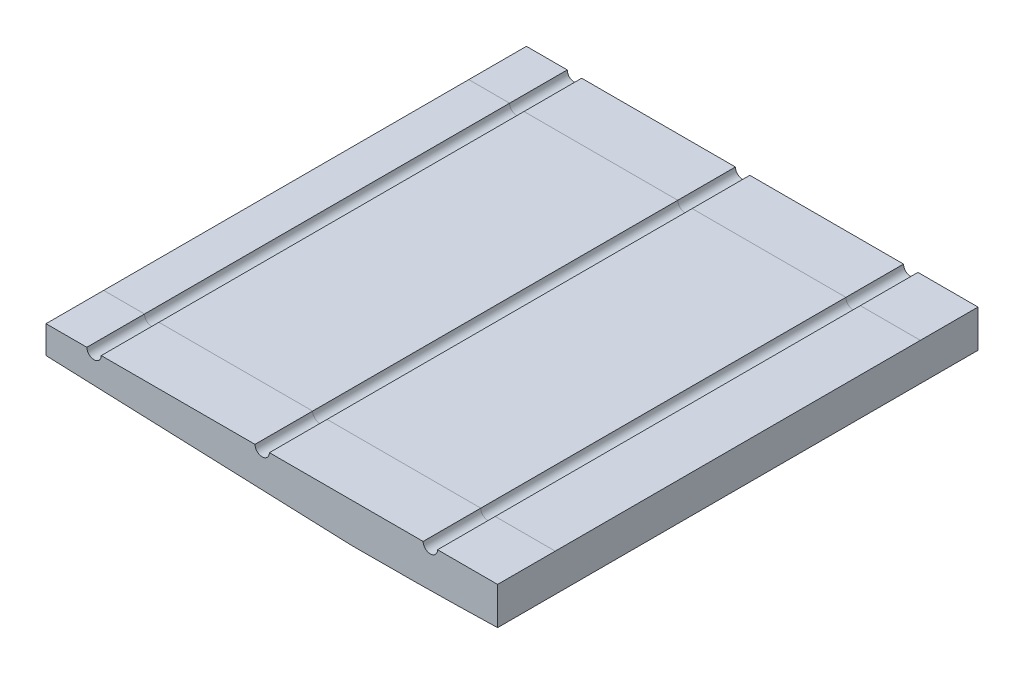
ISO-10303-21;
HEADER;
FILE_DESCRIPTION(('STEP AP214'),'2;1');
FILE_NAME('part.step','',(''),(''),'','','');
FILE_SCHEMA(('AUTOMOTIVE_DESIGN { 1 0 10303 214 1 1 1 1 }'));
ENDSEC;
DATA;
#1=APPLICATION_CONTEXT('core data for automotive mechanical design processes');
#2=APPLICATION_PROTOCOL_DEFINITION('international standard','automotive_design',2000,#1);
#3=PRODUCT_CONTEXT('',#1,'mechanical');
#4=PRODUCT('Part','Part','',(#3));
#5=PRODUCT_RELATED_PRODUCT_CATEGORY('part','',(#4));
#6=PRODUCT_DEFINITION_FORMATION('','',#4);
#7=PRODUCT_DEFINITION_CONTEXT('part definition',#1,'design');
#8=PRODUCT_DEFINITION('design','',#6,#7);
#9=PRODUCT_DEFINITION_SHAPE('','',#8);
#10=(LENGTH_UNIT() NAMED_UNIT(*) SI_UNIT(.MILLI.,.METRE.));
#11=(NAMED_UNIT(*) PLANE_ANGLE_UNIT() SI_UNIT($,.RADIAN.));
#12=(NAMED_UNIT(*) SI_UNIT($,.STERADIAN.) SOLID_ANGLE_UNIT());
#13=UNCERTAINTY_MEASURE_WITH_UNIT(LENGTH_MEASURE(1.E-05),#10,'distance_accuracy_value','');
#14=(GEOMETRIC_REPRESENTATION_CONTEXT(3) GLOBAL_UNCERTAINTY_ASSIGNED_CONTEXT((#13)) GLOBAL_UNIT_ASSIGNED_CONTEXT((#10,
#11,#12)) REPRESENTATION_CONTEXT('',''));
#15=CARTESIAN_POINT('',(0.,0.,0.));
#16=DIRECTION('',(0.,0.,1.));
#17=DIRECTION('',(1.,0.,0.));
#18=AXIS2_PLACEMENT_3D('',#15,#16,#17);
#19=CARTESIAN_POINT('',(0.,5.75,100.));
#20=DIRECTION('',(0.,-1.,0.));
#21=DIRECTION('',(0.,0.,-1.));
#22=AXIS2_PLACEMENT_3D('',#19,#20,#21);
#23=PLANE('',#22);
#24=DIRECTION('',(1.,0.,0.));
#25=VECTOR('',#24,1.);
#26=CARTESIAN_POINT('',(0.,5.75,12.));
#27=LINE('',#26,#25);
#28=CARTESIAN_POINT('',(11.5,5.75,12.));
#29=VERTEX_POINT('',#28);
#30=CARTESIAN_POINT('',(43.5,5.75,12.));
#31=VERTEX_POINT('',#30);
#32=EDGE_CURVE('E11',#29,#31,#27,.T.);
#33=ORIENTED_EDGE('',*,*,#32,.F.);
#34=DIRECTION('',(0.,0.,1.));
#35=VECTOR('',#34,1.);
#36=CARTESIAN_POINT('',(11.5,5.75,0.));
#37=LINE('',#36,#35);
#38=CARTESIAN_POINT('',(11.5,5.75,88.));
#39=VERTEX_POINT('',#38);
#40=EDGE_CURVE('E328',#29,#39,#37,.T.);
#41=ORIENTED_EDGE('',*,*,#40,.T.);
#42=DIRECTION('',(1.,0.,0.));
#43=VECTOR('',#42,1.);
#44=CARTESIAN_POINT('',(0.,5.75,88.));
#45=LINE('',#44,#43);
#46=CARTESIAN_POINT('',(43.5,5.75,88.));
#47=VERTEX_POINT('',#46);
#48=EDGE_CURVE('E274',#39,#47,#45,.T.);
#49=ORIENTED_EDGE('',*,*,#48,.T.);
#50=DIRECTION('',(0.,0.,1.));
#51=VECTOR('',#50,1.);
#52=CARTESIAN_POINT('',(43.5,5.75,0.));
#53=LINE('',#52,#51);
#54=EDGE_CURVE('E441',#47,#31,#53,.F.);
#55=ORIENTED_EDGE('',*,*,#54,.T.);
#56=EDGE_LOOP('',(#33,#41,#49,#55));
#57=FACE_BOUND('',#56,.T.);
#58=ADVANCED_FACE('F46',(#57),#23,.F.);
#59=DIRECTION('',(1.,0.,0.));
#60=VECTOR('',#59,1.);
#61=CARTESIAN_POINT('',(0.,5.75,12.));
#62=LINE('',#61,#60);
#63=CARTESIAN_POINT('',(46.5,5.75,12.));
#64=VERTEX_POINT('',#63);
#65=CARTESIAN_POINT('',(78.5,5.75,12.));
#66=VERTEX_POINT('',#65);
#67=EDGE_CURVE('E57',#64,#66,#62,.T.);
#68=ORIENTED_EDGE('',*,*,#67,.F.);
#69=DIRECTION('',(0.,0.,1.));
#70=VECTOR('',#69,1.);
#71=CARTESIAN_POINT('',(46.5,5.75,0.));
#72=LINE('',#71,#70);
#73=CARTESIAN_POINT('',(46.5,5.75,88.));
#74=VERTEX_POINT('',#73);
#75=EDGE_CURVE('E431',#64,#74,#72,.T.);
#76=ORIENTED_EDGE('',*,*,#75,.T.);
#77=DIRECTION('',(1.,0.,0.));
#78=VECTOR('',#77,1.);
#79=CARTESIAN_POINT('',(0.,5.75,88.));
#80=LINE('',#79,#78);
#81=CARTESIAN_POINT('',(78.5,5.75,88.));
#82=VERTEX_POINT('',#81);
#83=EDGE_CURVE('E287',#74,#82,#80,.T.);
#84=ORIENTED_EDGE('',*,*,#83,.T.);
#85=DIRECTION('',(0.,0.,1.));
#86=VECTOR('',#85,1.);
#87=CARTESIAN_POINT('',(78.5,5.75,0.));
#88=LINE('',#87,#86);
#89=EDGE_CURVE('E198',#82,#66,#88,.F.);
#90=ORIENTED_EDGE('',*,*,#89,.T.);
#91=EDGE_LOOP('',(#68,#76,#84,#90));
#92=FACE_BOUND('',#91,.T.);
#93=ADVANCED_FACE('F494',(#92),#23,.F.);
#94=DIRECTION('',(1.,0.,0.));
#95=VECTOR('',#94,1.);
#96=CARTESIAN_POINT('',(0.,5.75,12.));
#97=LINE('',#96,#95);
#98=CARTESIAN_POINT('',(81.5,5.75,12.));
#99=VERTEX_POINT('',#98);
#100=CARTESIAN_POINT('',(94.,5.75,12.));
#101=VERTEX_POINT('',#100);
#102=EDGE_CURVE('E65',#99,#101,#97,.T.);
#103=ORIENTED_EDGE('',*,*,#102,.F.);
#104=DIRECTION('',(0.,0.,1.));
#105=VECTOR('',#104,1.);
#106=CARTESIAN_POINT('',(81.5,5.75,0.));
#107=LINE('',#106,#105);
#108=CARTESIAN_POINT('',(81.5,5.75,88.));
#109=VERTEX_POINT('',#108);
#110=EDGE_CURVE('E452',#99,#109,#107,.T.);
#111=ORIENTED_EDGE('',*,*,#110,.T.);
#112=DIRECTION('',(1.,0.,0.));
#113=VECTOR('',#112,1.);
#114=CARTESIAN_POINT('',(0.,5.75,88.));
#115=LINE('',#114,#113);
#116=CARTESIAN_POINT('',(94.,5.75,88.));
#117=VERTEX_POINT('',#116);
#118=EDGE_CURVE('E280',#109,#117,#115,.T.);
#119=ORIENTED_EDGE('',*,*,#118,.T.);
#120=DIRECTION('',(0.,0.,-1.));
#121=VECTOR('',#120,1.);
#122=CARTESIAN_POINT('',(94.,5.75,100.));
#123=LINE('',#122,#121);
#124=EDGE_CURVE('E264',#117,#101,#123,.T.);
#125=ORIENTED_EDGE('',*,*,#124,.T.);
#126=EDGE_LOOP('',(#103,#111,#119,#125));
#127=FACE_BOUND('',#126,.T.);
#128=ADVANCED_FACE('F473',(#127),#23,.F.);
#129=DIRECTION('',(1.,0.,0.));
#130=VECTOR('',#129,1.);
#131=CARTESIAN_POINT('',(0.,5.75,12.));
#132=LINE('',#131,#130);
#133=CARTESIAN_POINT('',(0.,5.75,12.));
#134=VERTEX_POINT('',#133);
#135=CARTESIAN_POINT('',(8.5,5.75,12.));
#136=VERTEX_POINT('',#135);
#137=EDGE_CURVE('E73',#134,#136,#132,.T.);
#138=ORIENTED_EDGE('',*,*,#137,.F.);
#139=DIRECTION('',(0.,0.,-1.));
#140=VECTOR('',#139,1.);
#141=CARTESIAN_POINT('',(0.,5.75,100.));
#142=LINE('',#141,#140);
#143=CARTESIAN_POINT('',(0.,5.75,88.));
#144=VERTEX_POINT('',#143);
#145=EDGE_CURVE('E259',#144,#134,#142,.T.);
#146=ORIENTED_EDGE('',*,*,#145,.F.);
#147=DIRECTION('',(1.,0.,0.));
#148=VECTOR('',#147,1.);
#149=CARTESIAN_POINT('',(0.,5.75,88.));
#150=LINE('',#149,#148);
#151=CARTESIAN_POINT('',(8.5,5.75,88.));
#152=VERTEX_POINT('',#151);
#153=EDGE_CURVE('E275',#144,#152,#150,.T.);
#154=ORIENTED_EDGE('',*,*,#153,.T.);
#155=DIRECTION('',(0.,0.,1.));
#156=VECTOR('',#155,1.);
#157=CARTESIAN_POINT('',(8.5,5.75,0.));
#158=LINE('',#157,#156);
#159=EDGE_CURVE('E326',#152,#136,#158,.F.);
#160=ORIENTED_EDGE('',*,*,#159,.T.);
#161=EDGE_LOOP('',(#138,#146,#154,#160));
#162=FACE_BOUND('',#161,.T.);
#163=ADVANCED_FACE('F337',(#162),#23,.F.);
#164=CARTESIAN_POINT('',(80.,5.75,0.));
#165=DIRECTION('',(0.,0.,1.));
#166=DIRECTION('',(1.,0.,0.));
#167=AXIS2_PLACEMENT_3D('',#164,#165,#166);
#168=CYLINDRICAL_SURFACE('',#167,1.5);
#169=CARTESIAN_POINT('',(80.,5.75,12.));
#170=DIRECTION('',(0.,0.,-1.));
#171=DIRECTION('',(-1.,0.,0.));
#172=AXIS2_PLACEMENT_3D('',#169,#170,#171);
#173=CIRCLE('',#172,1.5);
#174=EDGE_CURVE('E303',#66,#99,#173,.F.);
#175=ORIENTED_EDGE('',*,*,#174,.F.);
#176=ORIENTED_EDGE('',*,*,#89,.F.);
#177=CARTESIAN_POINT('',(80.,5.75,88.));
#178=DIRECTION('',(0.,0.,-1.));
#179=DIRECTION('',(-1.,0.,0.));
#180=AXIS2_PLACEMENT_3D('',#177,#178,#179);
#181=CIRCLE('',#180,1.5);
#182=EDGE_CURVE('E283',#82,#109,#181,.F.);
#183=ORIENTED_EDGE('',*,*,#182,.T.);
#184=ORIENTED_EDGE('',*,*,#110,.F.);
#185=EDGE_LOOP('',(#175,#176,#183,#184));
#186=FACE_BOUND('',#185,.T.);
#187=ADVANCED_FACE('F477',(#186),#168,.F.);
#188=CARTESIAN_POINT('',(45.,5.75,0.));
#189=DIRECTION('',(0.,0.,1.));
#190=DIRECTION('',(1.,0.,0.));
#191=AXIS2_PLACEMENT_3D('',#188,#189,#190);
#192=CYLINDRICAL_SURFACE('',#191,1.5);
#193=CARTESIAN_POINT('',(45.,5.75,12.));
#194=DIRECTION('',(0.,0.,-1.));
#195=DIRECTION('',(-1.,0.,0.));
#196=AXIS2_PLACEMENT_3D('',#193,#194,#195);
#197=CIRCLE('',#196,1.5);
#198=EDGE_CURVE('E306',#31,#64,#197,.F.);
#199=ORIENTED_EDGE('',*,*,#198,.F.);
#200=ORIENTED_EDGE('',*,*,#54,.F.);
#201=CARTESIAN_POINT('',(45.,5.75,88.));
#202=DIRECTION('',(0.,0.,-1.));
#203=DIRECTION('',(-1.,0.,0.));
#204=AXIS2_PLACEMENT_3D('',#201,#202,#203);
#205=CIRCLE('',#204,1.5);
#206=EDGE_CURVE('E291',#47,#74,#205,.F.);
#207=ORIENTED_EDGE('',*,*,#206,.T.);
#208=ORIENTED_EDGE('',*,*,#75,.F.);
#209=EDGE_LOOP('',(#199,#200,#207,#208));
#210=FACE_BOUND('',#209,.T.);
#211=ADVANCED_FACE('F524',(#210),#192,.F.);
#212=CARTESIAN_POINT('',(10.,5.75,0.));
#213=DIRECTION('',(0.,0.,1.));
#214=DIRECTION('',(1.,0.,0.));
#215=AXIS2_PLACEMENT_3D('',#212,#213,#214);
#216=CYLINDRICAL_SURFACE('',#215,1.5);
#217=CARTESIAN_POINT('',(10.,5.75,12.));
#218=DIRECTION('',(0.,0.,-1.));
#219=DIRECTION('',(-1.,0.,0.));
#220=AXIS2_PLACEMENT_3D('',#217,#218,#219);
#221=CIRCLE('',#220,1.5);
#222=EDGE_CURVE('E51',#136,#29,#221,.F.);
#223=ORIENTED_EDGE('',*,*,#222,.F.);
#224=ORIENTED_EDGE('',*,*,#159,.F.);
#225=CARTESIAN_POINT('',(10.,5.75,88.));
#226=DIRECTION('',(0.,0.,-1.));
#227=DIRECTION('',(-1.,0.,0.));
#228=AXIS2_PLACEMENT_3D('',#225,#226,#227);
#229=CIRCLE('',#228,1.5);
#230=EDGE_CURVE('E279',#152,#39,#229,.F.);
#231=ORIENTED_EDGE('',*,*,#230,.T.);
#232=ORIENTED_EDGE('',*,*,#40,.F.);
#233=EDGE_LOOP('',(#223,#224,#231,#232));
#234=FACE_BOUND('',#233,.T.);
#235=ADVANCED_FACE('F325',(#234),#216,.F.);
#236=ORIENTED_EDGE('',*,*,#118,.F.);
#237=CARTESIAN_POINT('',(81.5,5.75,100.));
#238=VERTEX_POINT('',#237);
#239=EDGE_CURVE('E454',#109,#238,#107,.T.);
#240=ORIENTED_EDGE('',*,*,#239,.T.);
#241=DIRECTION('',(-1.,0.,0.));
#242=VECTOR('',#241,1.);
#243=CARTESIAN_POINT('',(0.,5.75,100.));
#244=LINE('',#243,#242);
#245=CARTESIAN_POINT('',(94.,5.75,100.));
#246=VERTEX_POINT('',#245);
#247=EDGE_CURVE('E360',#246,#238,#244,.T.);
#248=ORIENTED_EDGE('',*,*,#247,.F.);
#249=EDGE_CURVE('E260',#246,#117,#123,.T.);
#250=ORIENTED_EDGE('',*,*,#249,.T.);
#251=EDGE_LOOP('',(#236,#240,#248,#250));
#252=FACE_BOUND('',#251,.T.);
#253=ADVANCED_FACE('F468',(#252),#23,.F.);
#254=ORIENTED_EDGE('',*,*,#182,.F.);
#255=CARTESIAN_POINT('',(78.5,5.75,100.));
#256=VERTEX_POINT('',#255);
#257=EDGE_CURVE('E201',#256,#82,#88,.F.);
#258=ORIENTED_EDGE('',*,*,#257,.F.);
#259=CARTESIAN_POINT('',(80.,5.75,100.));
#260=DIRECTION('',(0.,0.,1.));
#261=DIRECTION('',(1.,0.,0.));
#262=AXIS2_PLACEMENT_3D('',#259,#260,#261);
#263=CIRCLE('',#262,1.5);
#264=EDGE_CURVE('E199',#256,#238,#263,.T.);
#265=ORIENTED_EDGE('',*,*,#264,.T.);
#266=ORIENTED_EDGE('',*,*,#239,.F.);
#267=EDGE_LOOP('',(#254,#258,#265,#266));
#268=FACE_BOUND('',#267,.T.);
#269=ADVANCED_FACE('F463',(#268),#168,.F.);
#270=ORIENTED_EDGE('',*,*,#83,.F.);
#271=CARTESIAN_POINT('',(46.5,5.75,100.));
#272=VERTEX_POINT('',#271);
#273=EDGE_CURVE('E432',#74,#272,#72,.T.);
#274=ORIENTED_EDGE('',*,*,#273,.T.);
#275=EDGE_CURVE('E365',#256,#272,#244,.T.);
#276=ORIENTED_EDGE('',*,*,#275,.F.);
#277=ORIENTED_EDGE('',*,*,#257,.T.);
#278=EDGE_LOOP('',(#270,#274,#276,#277));
#279=FACE_BOUND('',#278,.T.);
#280=ADVANCED_FACE('F539',(#279),#23,.F.);
#281=ORIENTED_EDGE('',*,*,#206,.F.);
#282=CARTESIAN_POINT('',(43.5,5.75,100.));
#283=VERTEX_POINT('',#282);
#284=EDGE_CURVE('E423',#283,#47,#53,.F.);
#285=ORIENTED_EDGE('',*,*,#284,.F.);
#286=CARTESIAN_POINT('',(45.,5.75,100.));
#287=DIRECTION('',(0.,0.,1.));
#288=DIRECTION('',(1.,0.,0.));
#289=AXIS2_PLACEMENT_3D('',#286,#287,#288);
#290=CIRCLE('',#289,1.5);
#291=EDGE_CURVE('E418',#283,#272,#290,.T.);
#292=ORIENTED_EDGE('',*,*,#291,.T.);
#293=ORIENTED_EDGE('',*,*,#273,.F.);
#294=EDGE_LOOP('',(#281,#285,#292,#293));
#295=FACE_BOUND('',#294,.T.);
#296=ADVANCED_FACE('F530',(#295),#192,.F.);
#297=ORIENTED_EDGE('',*,*,#230,.F.);
#298=CARTESIAN_POINT('',(8.5,5.75,100.));
#299=VERTEX_POINT('',#298);
#300=EDGE_CURVE('E336',#299,#152,#158,.F.);
#301=ORIENTED_EDGE('',*,*,#300,.F.);
#302=CARTESIAN_POINT('',(10.,5.75,100.));
#303=DIRECTION('',(0.,0.,1.));
#304=DIRECTION('',(1.,0.,0.));
#305=AXIS2_PLACEMENT_3D('',#302,#303,#304);
#306=CIRCLE('',#305,1.5);
#307=CARTESIAN_POINT('',(11.5,5.75,100.));
#308=VERTEX_POINT('',#307);
#309=EDGE_CURVE('E334',#299,#308,#306,.T.);
#310=ORIENTED_EDGE('',*,*,#309,.T.);
#311=EDGE_CURVE('E340',#39,#308,#37,.T.);
#312=ORIENTED_EDGE('',*,*,#311,.F.);
#313=EDGE_LOOP('',(#297,#301,#310,#312));
#314=FACE_BOUND('',#313,.T.);
#315=ADVANCED_FACE('F427',(#314),#216,.F.);
#316=ORIENTED_EDGE('',*,*,#153,.F.);
#317=CARTESIAN_POINT('',(0.,5.75,100.));
#318=VERTEX_POINT('',#317);
#319=EDGE_CURVE('E254',#318,#144,#142,.T.);
#320=ORIENTED_EDGE('',*,*,#319,.F.);
#321=EDGE_CURVE('E359',#299,#318,#244,.T.);
#322=ORIENTED_EDGE('',*,*,#321,.F.);
#323=ORIENTED_EDGE('',*,*,#300,.T.);
#324=EDGE_LOOP('',(#316,#320,#322,#323));
#325=FACE_BOUND('',#324,.T.);
#326=ADVANCED_FACE('F405',(#325),#23,.F.);
#327=ORIENTED_EDGE('',*,*,#48,.F.);
#328=ORIENTED_EDGE('',*,*,#311,.T.);
#329=EDGE_CURVE('E411',#283,#308,#244,.T.);
#330=ORIENTED_EDGE('',*,*,#329,.F.);
#331=ORIENTED_EDGE('',*,*,#284,.T.);
#332=EDGE_LOOP('',(#327,#328,#330,#331));
#333=FACE_BOUND('',#332,.T.);
#334=ADVANCED_FACE('F422',(#333),#23,.F.);
#335=CARTESIAN_POINT('',(11.5,5.75,0.));
#336=VERTEX_POINT('',#335);
#337=EDGE_CURVE('E344',#336,#29,#37,.T.);
#338=ORIENTED_EDGE('',*,*,#337,.T.);
#339=ORIENTED_EDGE('',*,*,#32,.T.);
#340=CARTESIAN_POINT('',(43.5,5.75,0.));
#341=VERTEX_POINT('',#340);
#342=EDGE_CURVE('E442',#31,#341,#53,.F.);
#343=ORIENTED_EDGE('',*,*,#342,.T.);
#344=DIRECTION('',(-1.,0.,0.));
#345=VECTOR('',#344,1.);
#346=CARTESIAN_POINT('',(0.,5.75,0.));
#347=LINE('',#346,#345);
#348=EDGE_CURVE('E220',#341,#336,#347,.T.);
#349=ORIENTED_EDGE('',*,*,#348,.T.);
#350=EDGE_LOOP('',(#338,#339,#343,#349));
#351=FACE_BOUND('',#350,.T.);
#352=ADVANCED_FACE('F513',(#351),#23,.F.);
#353=CARTESIAN_POINT('',(46.5,5.75,0.));
#354=VERTEX_POINT('',#353);
#355=EDGE_CURVE('E429',#354,#64,#72,.T.);
#356=ORIENTED_EDGE('',*,*,#355,.T.);
#357=ORIENTED_EDGE('',*,*,#67,.T.);
#358=CARTESIAN_POINT('',(78.5,5.75,0.));
#359=VERTEX_POINT('',#358);
#360=EDGE_CURVE('E187',#66,#359,#88,.F.);
#361=ORIENTED_EDGE('',*,*,#360,.T.);
#362=EDGE_CURVE('E192',#359,#354,#347,.T.);
#363=ORIENTED_EDGE('',*,*,#362,.T.);
#364=EDGE_LOOP('',(#356,#357,#361,#363));
#365=FACE_BOUND('',#364,.T.);
#366=ADVANCED_FACE('F190',(#365),#23,.F.);
#367=CARTESIAN_POINT('',(81.5,5.75,0.));
#368=VERTEX_POINT('',#367);
#369=EDGE_CURVE('E205',#368,#99,#107,.T.);
#370=ORIENTED_EDGE('',*,*,#369,.T.);
#371=ORIENTED_EDGE('',*,*,#102,.T.);
#372=CARTESIAN_POINT('',(94.,5.75,0.));
#373=VERTEX_POINT('',#372);
#374=EDGE_CURVE('E258',#101,#373,#123,.T.);
#375=ORIENTED_EDGE('',*,*,#374,.T.);
#376=EDGE_CURVE('E219',#373,#368,#347,.T.);
#377=ORIENTED_EDGE('',*,*,#376,.T.);
#378=EDGE_LOOP('',(#370,#371,#375,#377));
#379=FACE_BOUND('',#378,.T.);
#380=ADVANCED_FACE('F479',(#379),#23,.F.);
#381=CARTESIAN_POINT('',(76.9671929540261,-2.37057188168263,100.));
#382=CARTESIAN_POINT('',(82.6440316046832,-2.26572379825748,100.));
#383=CARTESIAN_POINT('',(88.3253253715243,-2.26443776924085,100.));
#384=CARTESIAN_POINT('',(94.,-2.05257454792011,100.));
#385=B_SPLINE_CURVE_WITH_KNOTS('',3,(#381,#382,#383,#384),.UNSPECIFIED.,.F.,.F.,(4,4),
(0.59092756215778,0.626803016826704),.UNSPECIFIED.);
#386=DIRECTION('',(0.,0.,-1.));
#387=VECTOR('',#386,1.);
#388=SURFACE_OF_LINEAR_EXTRUSION('',#385,#387);
#389=CARTESIAN_POINT('',(76.9671929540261,-2.37057188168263,0.));
#390=CARTESIAN_POINT('',(82.6440316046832,-2.26572379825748,0.));
#391=CARTESIAN_POINT('',(88.3253253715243,-2.26443776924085,0.));
#392=CARTESIAN_POINT('',(94.,-2.05257454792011,0.));
#393=B_SPLINE_CURVE_WITH_KNOTS('',3,(#389,#390,#391,#392),.UNSPECIFIED.,.F.,.F.,(4,4),
(0.59092756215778,0.626803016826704),.UNSPECIFIED.);
#394=CARTESIAN_POINT('',(76.967192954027,-2.37057188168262,0.));
#395=VERTEX_POINT('',#394);
#396=CARTESIAN_POINT('',(93.9999999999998,-2.05257454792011,0.));
#397=VERTEX_POINT('',#396);
#398=EDGE_CURVE('E346',#395,#397,#393,.T.);
#399=ORIENTED_EDGE('',*,*,#398,.T.);
#400=DIRECTION('',(0.,0.,-1.));
#401=VECTOR('',#400,1.);
#402=CARTESIAN_POINT('',(93.9999999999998,-2.05257454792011,100.));
#403=LINE('',#402,#401);
#404=CARTESIAN_POINT('',(93.9999999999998,-2.05257454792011,100.));
#405=VERTEX_POINT('',#404);
#406=EDGE_CURVE('E211',#405,#397,#403,.T.);
#407=ORIENTED_EDGE('',*,*,#406,.F.);
#408=CARTESIAN_POINT('',(76.967192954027,-2.37057188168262,100.));
#409=VERTEX_POINT('',#408);
#410=EDGE_CURVE('E239',#409,#405,#385,.T.);
#411=ORIENTED_EDGE('',*,*,#410,.F.);
#412=DIRECTION('',(0.,0.,-1.));
#413=VECTOR('',#412,1.);
#414=CARTESIAN_POINT('',(76.967192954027,-2.37057188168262,100.));
#415=LINE('',#414,#413);
#416=EDGE_CURVE('E240',#409,#395,#415,.T.);
#417=ORIENTED_EDGE('',*,*,#416,.T.);
#418=EDGE_LOOP('',(#399,#407,#411,#417));
#419=FACE_BOUND('',#418,.T.);
#420=ADVANCED_FACE('F48',(#419),#388,.F.);
#421=CARTESIAN_POINT('',(94.,5.75,100.));
#422=DIRECTION('',(-1.,0.,0.));
#423=DIRECTION('',(0.,-1.,0.));
#424=AXIS2_PLACEMENT_3D('',#421,#422,#423);
#425=PLANE('',#424);
#426=DIRECTION('',(0.,1.,0.));
#427=VECTOR('',#426,1.);
#428=CARTESIAN_POINT('',(94.,5.75,0.));
#429=LINE('',#428,#427);
#430=EDGE_CURVE('E229',#397,#373,#429,.T.);
#431=ORIENTED_EDGE('',*,*,#430,.T.);
#432=ORIENTED_EDGE('',*,*,#374,.F.);
#433=ORIENTED_EDGE('',*,*,#124,.F.);
#434=ORIENTED_EDGE('',*,*,#249,.F.);
#435=DIRECTION('',(0.,1.,0.));
#436=VECTOR('',#435,1.);
#437=CARTESIAN_POINT('',(94.,5.75,100.));
#438=LINE('',#437,#436);
#439=EDGE_CURVE('E353',#405,#246,#438,.T.);
#440=ORIENTED_EDGE('',*,*,#439,.F.);
#441=ORIENTED_EDGE('',*,*,#406,.T.);
#442=EDGE_LOOP('',(#431,#432,#433,#434,#440,#441));
#443=FACE_BOUND('',#442,.T.);
#444=ADVANCED_FACE('F480',(#443),#425,.F.);
#445=CARTESIAN_POINT('',(0.,5.75,0.));
#446=VERTEX_POINT('',#445);
#447=EDGE_CURVE('E253',#134,#446,#142,.T.);
#448=ORIENTED_EDGE('',*,*,#447,.F.);
#449=ORIENTED_EDGE('',*,*,#137,.T.);
#450=CARTESIAN_POINT('',(8.5,5.75,0.));
#451=VERTEX_POINT('',#450);
#452=EDGE_CURVE('E318',#136,#451,#158,.F.);
#453=ORIENTED_EDGE('',*,*,#452,.T.);
#454=EDGE_CURVE('E225',#451,#446,#347,.T.);
#455=ORIENTED_EDGE('',*,*,#454,.T.);
#456=EDGE_LOOP('',(#448,#449,#453,#455));
#457=FACE_BOUND('',#456,.T.);
#458=ADVANCED_FACE('F315',(#457),#23,.F.);
#459=CARTESIAN_POINT('',(0.,5.75,100.));
#460=DIRECTION('',(1.,0.,0.));
#461=DIRECTION('',(0.,1.,0.));
#462=AXIS2_PLACEMENT_3D('',#459,#460,#461);
#463=PLANE('',#462);
#464=DIRECTION('',(0.,-1.,0.));
#465=VECTOR('',#464,1.);
#466=CARTESIAN_POINT('',(0.,5.75,0.));
#467=LINE('',#466,#465);
#468=CARTESIAN_POINT('',(0.,0.,0.));
#469=VERTEX_POINT('',#468);
#470=EDGE_CURVE('E224',#446,#469,#467,.T.);
#471=ORIENTED_EDGE('',*,*,#470,.T.);
#472=DIRECTION('',(0.,0.,-1.));
#473=VECTOR('',#472,1.);
#474=CARTESIAN_POINT('',(0.,0.,100.));
#475=LINE('',#474,#473);
#476=CARTESIAN_POINT('',(0.,0.,100.));
#477=VERTEX_POINT('',#476);
#478=EDGE_CURVE('E249',#477,#469,#475,.T.);
#479=ORIENTED_EDGE('',*,*,#478,.F.);
#480=DIRECTION('',(0.,-1.,0.));
#481=VECTOR('',#480,1.);
#482=CARTESIAN_POINT('',(0.,5.75,100.));
#483=LINE('',#482,#481);
#484=EDGE_CURVE('E364',#318,#477,#483,.T.);
#485=ORIENTED_EDGE('',*,*,#484,.F.);
#486=ORIENTED_EDGE('',*,*,#319,.T.);
#487=ORIENTED_EDGE('',*,*,#145,.T.);
#488=ORIENTED_EDGE('',*,*,#447,.T.);
#489=EDGE_LOOP('',(#471,#479,#485,#486,#487,#488));
#490=FACE_BOUND('',#489,.T.);
#491=ADVANCED_FACE('F391',(#490),#463,.F.);
#492=CARTESIAN_POINT('',(0.,0.,100.));
#493=DIRECTION('',(0.0380206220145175,0.9992769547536,0.));
#494=DIRECTION('',(-0.9992769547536,0.0380206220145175,0.));
#495=AXIS2_PLACEMENT_3D('',#492,#493,#494);
#496=PLANE('',#495);
#497=DIRECTION('',(0.9992769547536,-0.0380206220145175,0.));
#498=VECTOR('',#497,1.);
#499=CARTESIAN_POINT('',(0.,0.,0.));
#500=LINE('',#499,#498);
#501=CARTESIAN_POINT('',(63.6108463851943,-2.4202739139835,0.));
#502=VERTEX_POINT('',#501);
#503=EDGE_CURVE('E233',#469,#502,#500,.T.);
#504=ORIENTED_EDGE('',*,*,#503,.T.);
#505=DIRECTION('',(0.,0.,-1.));
#506=VECTOR('',#505,1.);
#507=CARTESIAN_POINT('',(63.6108463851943,-2.4202739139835,100.));
#508=LINE('',#507,#506);
#509=CARTESIAN_POINT('',(63.6108463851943,-2.4202739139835,100.));
#510=VERTEX_POINT('',#509);
#511=EDGE_CURVE('E244',#510,#502,#508,.T.);
#512=ORIENTED_EDGE('',*,*,#511,.F.);
#513=DIRECTION('',(0.9992769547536,-0.0380206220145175,0.));
#514=VECTOR('',#513,1.);
#515=CARTESIAN_POINT('',(0.,0.,100.));
#516=LINE('',#515,#514);
#517=EDGE_CURVE('E368',#477,#510,#516,.T.);
#518=ORIENTED_EDGE('',*,*,#517,.F.);
#519=ORIENTED_EDGE('',*,*,#478,.T.);
#520=EDGE_LOOP('',(#504,#512,#518,#519));
#521=FACE_BOUND('',#520,.T.);
#522=ADVANCED_FACE('F395',(#521),#496,.F.);
#523=CARTESIAN_POINT('',(63.6108463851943,-2.4202739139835,100.));
#524=DIRECTION('',(-0.0037212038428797,0.999993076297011,0.));
#525=DIRECTION('',(-0.999993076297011,-0.0037212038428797,0.));
#526=AXIS2_PLACEMENT_3D('',#523,#524,#525);
#527=PLANE('',#526);
#528=DIRECTION('',(0.999993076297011,0.0037212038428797,0.));
#529=VECTOR('',#528,1.);
#530=CARTESIAN_POINT('',(63.6108463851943,-2.4202739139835,0.));
#531=LINE('',#530,#529);
#532=EDGE_CURVE('E236',#502,#395,#531,.T.);
#533=ORIENTED_EDGE('',*,*,#532,.T.);
#534=ORIENTED_EDGE('',*,*,#416,.F.);
#535=DIRECTION('',(0.999993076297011,0.0037212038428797,0.));
#536=VECTOR('',#535,1.);
#537=CARTESIAN_POINT('',(63.6108463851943,-2.4202739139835,100.));
#538=LINE('',#537,#536);
#539=EDGE_CURVE('E245',#510,#409,#538,.T.);
#540=ORIENTED_EDGE('',*,*,#539,.F.);
#541=ORIENTED_EDGE('',*,*,#511,.T.);
#542=EDGE_LOOP('',(#533,#534,#540,#541));
#543=FACE_BOUND('',#542,.T.);
#544=ADVANCED_FACE('F483',(#543),#527,.F.);
#545=CARTESIAN_POINT('',(85.484407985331,-2.25170389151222,100.));
#546=DIRECTION('',(0.,0.,1.));
#547=DIRECTION('',(1.,0.,0.));
#548=AXIS2_PLACEMENT_3D('',#545,#546,#547);
#549=PLANE('',#548);
#550=ORIENTED_EDGE('',*,*,#309,.F.);
#551=ORIENTED_EDGE('',*,*,#321,.T.);
#552=ORIENTED_EDGE('',*,*,#484,.T.);
#553=ORIENTED_EDGE('',*,*,#517,.T.);
#554=ORIENTED_EDGE('',*,*,#539,.T.);
#555=ORIENTED_EDGE('',*,*,#410,.T.);
#556=ORIENTED_EDGE('',*,*,#439,.T.);
#557=ORIENTED_EDGE('',*,*,#247,.T.);
#558=ORIENTED_EDGE('',*,*,#264,.F.);
#559=ORIENTED_EDGE('',*,*,#275,.T.);
#560=ORIENTED_EDGE('',*,*,#291,.F.);
#561=ORIENTED_EDGE('',*,*,#329,.T.);
#562=EDGE_LOOP('',(#550,#551,#552,#553,#554,#555,#556,#557,#558,#559,#560,#561));
#563=FACE_BOUND('',#562,.T.);
#564=ADVANCED_FACE('F400',(#563),#549,.T.);
#565=CARTESIAN_POINT('',(85.484407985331,-2.25170389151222,0.));
#566=DIRECTION('',(0.,0.,1.));
#567=DIRECTION('',(1.,0.,0.));
#568=AXIS2_PLACEMENT_3D('',#565,#566,#567);
#569=PLANE('',#568);
#570=ORIENTED_EDGE('',*,*,#454,.F.);
#571=CARTESIAN_POINT('',(10.,5.75,0.));
#572=DIRECTION('',(0.,0.,1.));
#573=DIRECTION('',(1.,0.,0.));
#574=AXIS2_PLACEMENT_3D('',#571,#572,#573);
#575=CIRCLE('',#574,1.5);
#576=EDGE_CURVE('E270',#451,#336,#575,.T.);
#577=ORIENTED_EDGE('',*,*,#576,.T.);
#578=ORIENTED_EDGE('',*,*,#348,.F.);
#579=CARTESIAN_POINT('',(45.,5.75,0.));
#580=DIRECTION('',(0.,0.,1.));
#581=DIRECTION('',(1.,0.,0.));
#582=AXIS2_PLACEMENT_3D('',#579,#580,#581);
#583=CIRCLE('',#582,1.5);
#584=EDGE_CURVE('E210',#341,#354,#583,.T.);
#585=ORIENTED_EDGE('',*,*,#584,.T.);
#586=ORIENTED_EDGE('',*,*,#362,.F.);
#587=CARTESIAN_POINT('',(80.,5.75,0.));
#588=DIRECTION('',(0.,0.,1.));
#589=DIRECTION('',(1.,0.,0.));
#590=AXIS2_PLACEMENT_3D('',#587,#588,#589);
#591=CIRCLE('',#590,1.5);
#592=EDGE_CURVE('E203',#359,#368,#591,.T.);
#593=ORIENTED_EDGE('',*,*,#592,.T.);
#594=ORIENTED_EDGE('',*,*,#376,.F.);
#595=ORIENTED_EDGE('',*,*,#430,.F.);
#596=ORIENTED_EDGE('',*,*,#398,.F.);
#597=ORIENTED_EDGE('',*,*,#532,.F.);
#598=ORIENTED_EDGE('',*,*,#503,.F.);
#599=ORIENTED_EDGE('',*,*,#470,.F.);
#600=EDGE_LOOP('',(#570,#577,#578,#585,#586,#593,#594,#595,#596,#597,#598,#599));
#601=FACE_BOUND('',#600,.T.);
#602=ADVANCED_FACE('F215',(#601),#569,.F.);
#603=ORIENTED_EDGE('',*,*,#360,.F.);
#604=ORIENTED_EDGE('',*,*,#174,.T.);
#605=ORIENTED_EDGE('',*,*,#369,.F.);
#606=ORIENTED_EDGE('',*,*,#592,.F.);
#607=EDGE_LOOP('',(#603,#604,#605,#606));
#608=FACE_BOUND('',#607,.T.);
#609=ADVANCED_FACE('F204',(#608),#168,.F.);
#610=ORIENTED_EDGE('',*,*,#342,.F.);
#611=ORIENTED_EDGE('',*,*,#198,.T.);
#612=ORIENTED_EDGE('',*,*,#355,.F.);
#613=ORIENTED_EDGE('',*,*,#584,.F.);
#614=EDGE_LOOP('',(#610,#611,#612,#613));
#615=FACE_BOUND('',#614,.T.);
#616=ADVANCED_FACE('F526',(#615),#192,.F.);
#617=ORIENTED_EDGE('',*,*,#452,.F.);
#618=ORIENTED_EDGE('',*,*,#222,.T.);
#619=ORIENTED_EDGE('',*,*,#337,.F.);
#620=ORIENTED_EDGE('',*,*,#576,.F.);
#621=EDGE_LOOP('',(#617,#618,#619,#620));
#622=FACE_BOUND('',#621,.T.);
#623=ADVANCED_FACE('F332',(#622),#216,.F.);
#624=CLOSED_SHELL('',(#58,#93,#128,#163,#187,#211,#235,#253,#269,#280,#296,#315,#326,#334,#352,
#366,#380,#420,#444,#458,#491,#522,#544,#564,#602,#609,#616,#623));
#625=MANIFOLD_SOLID_BREP('B2',#624);
#626=ADVANCED_BREP_SHAPE_REPRESENTATION('',(#18,#625),#14);
#627=SHAPE_DEFINITION_REPRESENTATION(#9,#626);
ENDSEC;
END-ISO-10303-21;
